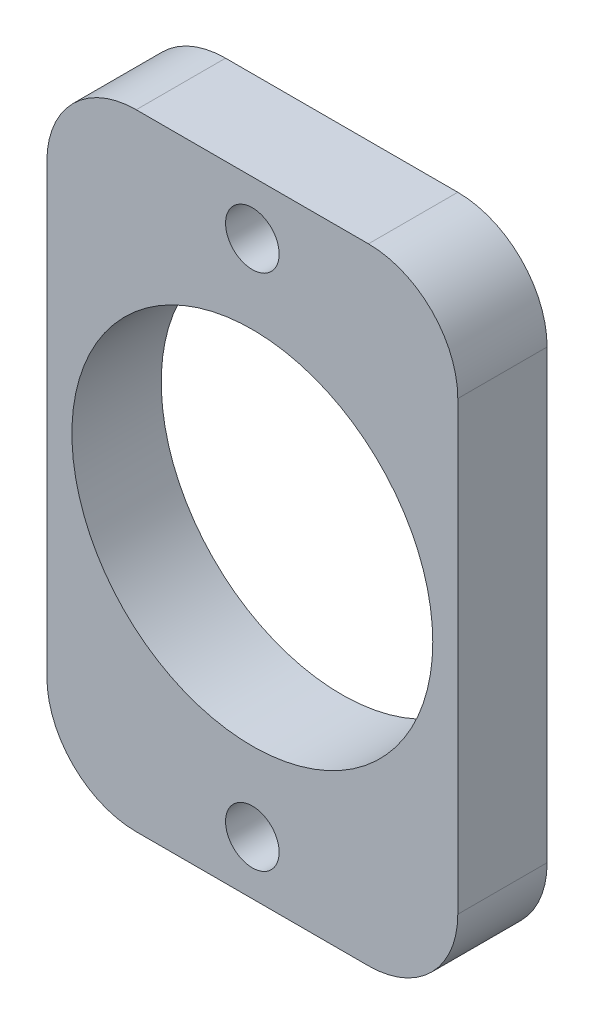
from build123d import *

# Parameters (mm, degrees)
ESQUISSE1_W        = 23
ESQUISSE1_H        = 35
ESQUISSE1_R        = 10.1
ESQUISSE1_R_2      = 1.5
BOSS_EXTRU_1_DEPTH = 5
CONG_1_R           = 5


with BuildPart() as part:
    # Esquisse1 → Boss.-Extru.1 (new body)
    with BuildSketch(Plane.XY):
        Rectangle(ESQUISSE1_W, ESQUISSE1_H)
        Circle(ESQUISSE1_R, mode=Mode.SUBTRACT)
        with Locations((0, 14.5)):
            Circle(ESQUISSE1_R_2, mode=Mode.SUBTRACT)
        with Locations((0, -14.5)):
            Circle(ESQUISSE1_R_2, mode=Mode.SUBTRACT)
    extrude(amount=BOSS_EXTRU_1_DEPTH)

    # Cong_1
    cong_1_edges = [part.edges().sort_by_distance(p)[0] for p in [
        (-11.5, 17.5, 2.5),
        (11.5, 17.5, 2.5),
        (11.5, -17.5, 2.5),
        (-11.5, -17.5, 2.5),
    ]]
    fillet(cong_1_edges, radius=CONG_1_R)


solid = part.part
